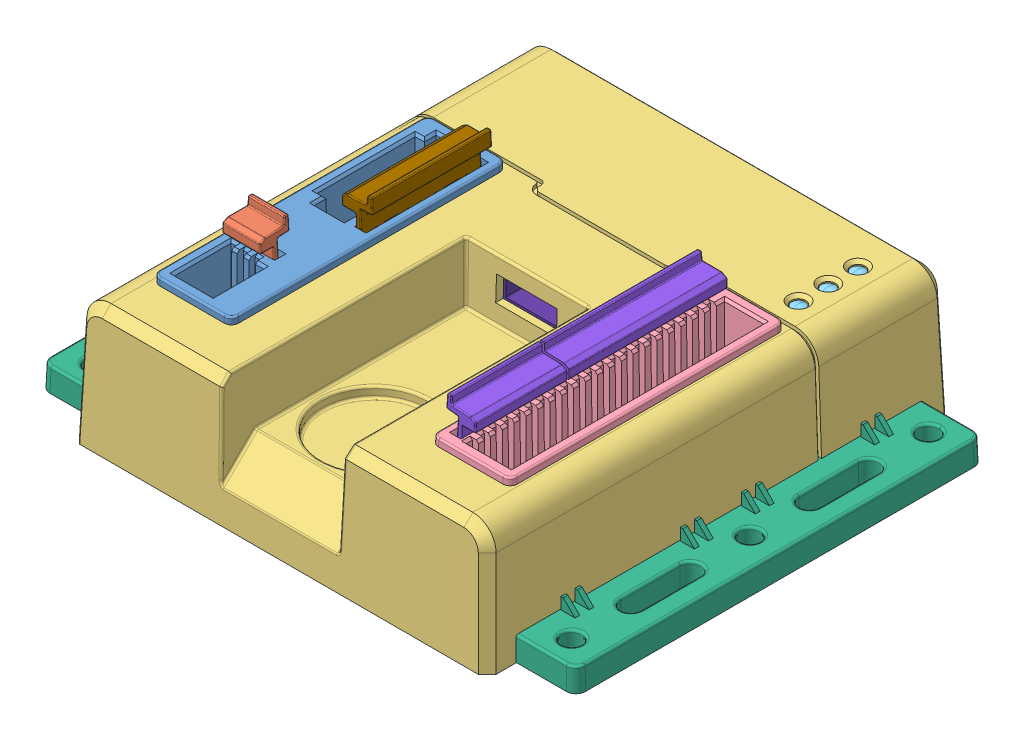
SolidWorks assembly 276-2194 Rev0.sldasm, configuration Default (file format 4400). Lengths in mm.
Overall size (114.3 34.95 101.48).
23 component instances, 17 part files, 0 mates.
Components (placement in the parent):
- 276-2194-MOTOR_LOCK_BUCKET-1: 276-2194-MOTOR_LOCK_BUCKET.sldprt [Default] at (-118.4929 92.6879 9.5108) x (0 0 1) z (-1 0 0) size (58.8 12.99 16.86)
- 276-2194-SMALL_LOCK_TAB-1: 276-2194-SMALL_LOCK_TAB.sldprt [Default] at (-120.5338 95.1009 26.349) x (-1 0 0) z (0 0 -1) size (8.23 15.64 6.46)
- 276-2194-001 ORIGINAL TOP_CASE_4_1-1: 276-2194-001 ORIGINAL TOP_CASE_4_1.sldprt [Default] at (-88.7425 64.551 0.3382) size (88.9 26.64 99.48)
- 276-2194-PWM_LOCK_BUCKET-1: 276-2194-PWM_LOCK_BUCKET.sldprt [Default] at (-58.9991 92.6879 9.5108) x (0 0 -1) z (1 0 0) size (58.74 12.93 16.8)
- 276-2194-LIGHTPIPE-1: 276-2194-LIGHTPIPE.sldprt [Default] at (-56.6115 86.5919 -39.2414) x (-1 0 0) z (0 0 1) size (8.38 17.16 3.05)
- 276-2194-LIGHTPIPE-2: 276-2194-LIGHTPIPE.sldprt [Default] at (-56.6115 86.5919 -26.5414) x (-1 0 0) z (0 0 1) size (8.38 17.16 3.05)
- 276-2194-BOTTOM-CASE-1: 276-2194-BOTTOM-CASE.sldprt [Default] at (-88.7425 69.5523 0.3382) size (114.3 23.65 99.4)
- 276-2194-SWITCH_BUTTON-1: 276-2194-SWITCH_BUTTON.sldprt [Default] at (-119.016 79.6761 -46.6328) x (1 0 0) z (0 1 0) size (5.9 8.5 11)
- 276-2194-LONG_LOCK_TAB-1: 276-2194-LONG_LOCK_TAB.sldprt [Default] at (-60.4629 95.0522 9.5108) x (0 0 1) z (-0.999962 0.008727 0) size (53.84 15.56 6.5)
- 276-2194-SHORT_LOCK_TAB-1: 276-2194-SHORT_LOCK_TAB.sldprt [Default] at (-116.9776 95.1009 -10.8092) x (0 0 -1) z (1 0 0) size (26.15 15.52 6.44)
- 276-2194-100 2_0_PCB_ASSY-1: 276-2194-100 2_0_PCB_ASSY.sldasm [Default] at (-92.1962 77.0281 -1.704) size (80 20.64 93.82)
  - 276-2194-100 MICROCONTROLLER-PCB-PIN4_ANY_1_1-1: 276-2194-100 MICROCONTROLLER-PCB-PIN4_ANY_1_1.sldprt [Default] at (11.4314 0.899 -46.0581) x (-1 0 0) z (0 1 0) size (11.2 18 15.1)
  - 276-2194-100 WIFI_PCB_2PIN-MALE_BATTBKP_ANY__1-1: 276-2194-100 WIFI_PCB_2PIN-MALE_BATTBKP_ANY__1.sldprt [Default] at (19.9917 -4.901 -37.7089) x (-1 0 0) z (0 0 -1) size (4.83 2.54 8.38)
  - 276-2194-2_0_BATT-POWER_SWITCH_REV1_ANY_ASM-1: 276-2194-2_0_BATT-POWER_SWITCH_REV1_ANY_ASM.sldasm [Default] at (-0.6688 -4.901 2.0411) size (23.52 16.6 24.02)
    - 276-2194-NONE-47360-1: 276-2194-NONE-47360.sldprt [Default] at origin size (6.65 12.7 22.89)
    - 276-2194-NONE-42108-1: 276-2194-NONE-42108.sldprt [Default] at origin size (16.3 16.6 23.9)
  - 276-2194-RIGHT_ANGLE_MICRO_SWITCH_ANY-1: 276-2194-RIGHT_ANGLE_MICRO_SWITCH_ANY.sldprt [Default] at (29.9789 -1.351 -44.0157) x (-1 0 0) z (0 0 -1) size (7.4 10.9 7.8)
  - 276-2194-100 2_0_WIFI_PCB_REV1_ANY_1_1-1: 276-2194-100 2_0_WIFI_PCB_REV1_ANY_1_1.sldprt [Default] at (3.4537 -6.4758 2.0421) size (80 1.58 91.44)
  - 276-2194-100 MICROCONTROLLER-PCB-PIN4_ANY_1_1-2: 276-2194-100 MICROCONTROLLER-PCB-PIN4_ANY_1_1.sldprt [Default] at (-0.269 0.899 -46.0581) x (-1 0 0) z (0 1 0) size (11.2 18 15.1)
  - 276-2194-100 2_0_WIFI_CONTACT_BLOCK_REV1_ANY_1-1: 276-2194-100 2_0_WIFI_CONTACT_BLOCK_REV1_ANY_1.sldprt [Default] at (35.2063 -4.901 11.1722) x (0 0 1) z (-1 0 0) size (53.84 8.51 7.62)
  - 276-2194-100 2_0_WIFI_DOUBLE_STACK_USB_REV1__1-1: 276-2194-100 2_0_WIFI_DOUBLE_STACK_USB_REV1__1.sldprt [Default] at (3.4537 -4.901 -11.5215) size (15.35 20.55 16.99)
  - 276-2194-100 2_0_WIFI_CONTACT_BLOCK_REV1_ANY_1-2: 276-2194-100 2_0_WIFI_CONTACT_BLOCK_REV1_ANY_1.sldprt [Default] at (-28.2988 -4.901 11.1722) x (0 0 1) z (-1 0 0) size (53.84 8.51 7.62)
- 276-2194-LIGHTPIPE-3: 276-2194-LIGHTPIPE.sldprt [Default] at (-56.6115 86.5919 -32.8914) x (-1 0 0) z (0 0 1) size (8.38 17.16 3.05)
